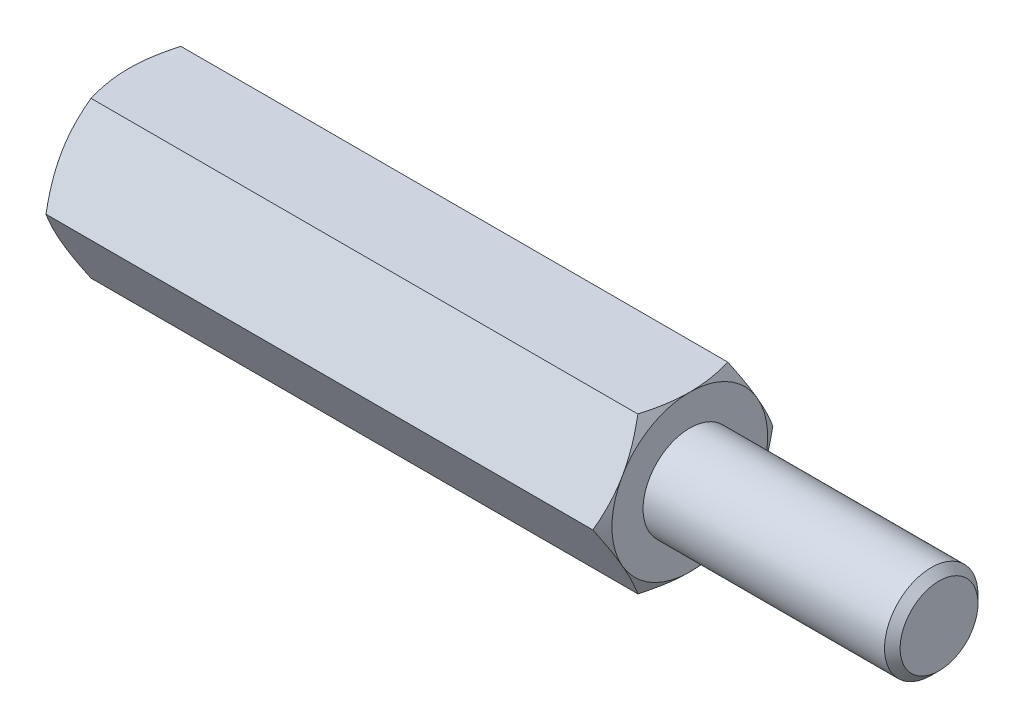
from build123d import *

# Parameters (mm, degrees)
EXTRUDE2_DEPTH = 9
SKETCH3_R      = 1.25
EXTRUDE3_DEPTH = 8
SKETCH5_R      = 1.5
EXTRUDE4_DEPTH = 8
CHAMFER1_SIZE  = 0.25


with BuildPart() as part:
    # Sketch1 → Extrude2 (new, symmetric)
    with BuildSketch(Plane(origin=(0, 0, 0), x_dir=(0, 0, -1), z_dir=(1, 0, 0))):
        Polygon((1.443375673, 2.5), (-1.443375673, 2.5), (-2.886751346, 0), (-1.443375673, -2.5), (1.443375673, -2.5), (2.886751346, 0), align=None)
    extrude(amount=EXTRUDE2_DEPTH, both=True)

    # Sketch2 → Cut-Revolve1 (revolve, cut)
    with BuildSketch(Plane.XY):
        with BuildLine():
            Line((-9, 2.5), (-7.5, 5.098076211))
            ThreePointArc((-7.5, 5.098076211), (-7.98810136, 6.276457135), (-9, 5.5))
            Line((-9, 5.5), (-9, 2.5))
        make_face()
    cut_revolve1 = revolve(axis=Axis((0, 0, 0), (1, 0, 0)), mode=Mode.SUBTRACT)

    # Mirror1: Cut-Revolve1 across plane
    add(cut_revolve1.mirror(Plane(origin=(0, 0, 0), x_dir=(0, 0, 1), z_dir=(1, 0, 0))), mode=Mode.SUBTRACT)

    # Sketch3 → Extrude3 (cut)
    with BuildSketch(Plane.ZY.offset(9)):
        Circle(SKETCH3_R)
    extrude(amount=-EXTRUDE3_DEPTH, mode=Mode.SUBTRACT)

    # Sketch4 → Cut-Revolve2 (revolve, cut)
    with BuildSketch(Plane.XY, mode=Mode.PRIVATE) as cut_revolve2_sk:
        Polygon((-1, 0), (-1, 1.25), (-0.278312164, 0), align=None)
    revolve(cut_revolve2_sk.sketch.rotate(Axis((-0.278312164, 0, 0), (-1, 0, 0)), 270), axis=Axis((-0.278312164, 0, 0), (-1, 0, 0)), mode=Mode.SUBTRACT)

    # Sketch5 → Extrude4 (add)
    with BuildSketch(Plane(origin=(9, 0, 0), x_dir=(0, 0, -1), z_dir=(1, 0, 0))):
        Circle(SKETCH5_R)
    extrude(amount=EXTRUDE4_DEPTH)

    # Chamfer1
    chamfer1_edges = [part.edges().sort_by_distance(p)[0] for p in [
        (17, 0, 1.5),
    ]]
    chamfer(chamfer1_edges, length=CHAMFER1_SIZE)


solid = part.part
